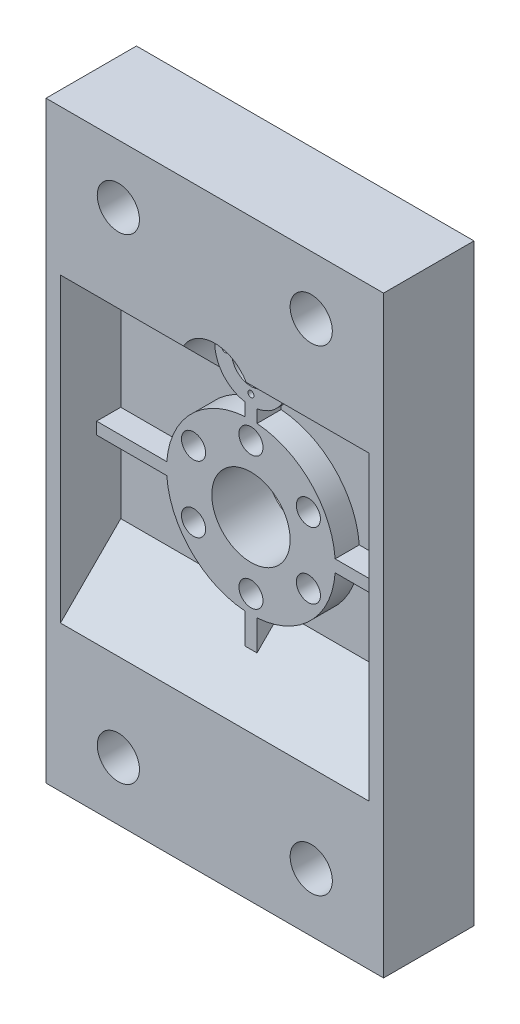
from build123d import *

# Parameters (mm, degrees)
SKETCH_1_W           = 280
SKETCH_1_H           = 492
SKETCH_1_R           = 32.5
SKETCH_1_R_2         = 17.5
SKETCH_1_R_3         = 16
EXTRUDE_1_DEPTH      = 75
SKETCH_2_W           = 122
SKETCH_2_H           = 85
SKETCH_2_R           = 17.5
CUT_EXTRUDE_1_DEPTH  = 50
CUT_EXTRUDE_3_DEPTH  = 122
CUT_EXTRUDE_4_DEPTH  = 122
EXTRUDE_2_REACH      = 294.816
SKETCH_7_W           = 256
SKETCH_7_H           = 150
CUT_EXTRUDE_5_DEPTH  = 50
CUT_EXTRUDE_6_REACH  = 373.436
CUT_EXTRUDE_START    = -30
SKETCH_9_R           = 30
SKETCH_9_R_2         = 16
CUT_EXTRUDE_7_DEPTH  = 30
EXTRUDE_5_REACH      = 288.603
SKETCH_11_R          = 70
SKETCH_11_R_2        = 32.5
EXTRUDE_6_DEPTH      = 20
EXTRUDE_START        = -20
EXTRUDE_7_DEPTH      = 20
EXTRUDE_8_REACH      = 360.142
SKETCH_13_W          = 10
SKETCH_13_H          = 20
SKETCH_14_R          = 2.5
CUT_EXTRUDE_8_DEPTH  = 13
SKETCH_15_R          = 6.5
CUT_EXTRUDE_9_DEPTH  = 287.602512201
SKETCH_16_R          = 10
CUT_EXTRUDE_10_DEPTH = 15


with BuildPart() as part:
    # Sketch 1 → Extrude 1 (new body)
    with BuildSketch(Plane.XY):
        Rectangle(SKETCH_1_W, SKETCH_1_H)
        Circle(SKETCH_1_R, mode=Mode.SUBTRACT)
        with Locations((80, 197.5)):
            Circle(SKETCH_1_R_2, mode=Mode.SUBTRACT)
        with Locations(Location((80, -197.5, 0), (0, 0, 180))):
            Circle(SKETCH_1_R_2, mode=Mode.SUBTRACT)
        with Locations((-80, -197.5)):
            Circle(SKETCH_1_R_2, mode=Mode.SUBTRACT)
        with Locations(Location((-80, 197.5, 0), (0, 0, 180))):
            Circle(SKETCH_1_R_2, mode=Mode.SUBTRACT)
        with Locations((0, 110)):
            Circle(SKETCH_1_R_3, mode=Mode.SUBTRACT)
    extrude(amount=EXTRUDE_1_DEPTH)

    # Sketch 2 → Cut-Extrude 1 (cut)
    # profile 1 of 4: a face of its own
    with BuildSketch(Plane(origin=(0, 0, 0), x_dir=(-1, 0, 0), z_dir=(0, 0, -1))):
        with Locations((67, -191.5)):
            Rectangle(SKETCH_2_W, SKETCH_2_H)
        with Locations((80, -197.5)):
            Circle(SKETCH_2_R, mode=Mode.SUBTRACT)
    # profile 2 of 4: a face of its own
    with BuildSketch(Plane(origin=(0, 0, 0), x_dir=(-1, 0, 0), z_dir=(0, 0, -1))):
        with Locations((-67, -191.5)):
            Rectangle(SKETCH_2_W, SKETCH_2_H)
        with Locations((-80, -197.5)):
            Circle(SKETCH_2_R, mode=Mode.SUBTRACT)
    # profile 3 of 4: a face of its own
    with BuildSketch(Plane(origin=(0, 0, 0), x_dir=(-1, 0, 0), z_dir=(0, 0, -1))):
        with Locations((67, 191.5)):
            Rectangle(SKETCH_2_W, SKETCH_2_H)
        with Locations((80, 197.5)):
            Circle(SKETCH_2_R, mode=Mode.SUBTRACT)
    # profile 4 of 4: a face of its own
    with BuildSketch(Plane(origin=(0, 0, 0), x_dir=(-1, 0, 0), z_dir=(0, 0, -1))):
        with Locations((-67, 191.5)):
            Rectangle(SKETCH_2_W, SKETCH_2_H)
        with Locations((-80, 197.5)):
            Circle(SKETCH_2_R, mode=Mode.SUBTRACT)
    extrude(amount=-CUT_EXTRUDE_1_DEPTH, mode=Mode.SUBTRACT)

    # Sketch 4 → Cut-Extrude 3 (cut)
    with BuildSketch(Plane(origin=(6, 0, 0), x_dir=(0, 0, -1), z_dir=(1, 0, 0))):
        Polygon((-50, 149), (0, 149), (0, 99), align=None)
        Polygon((0, -100.305438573), (-48.694561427, -149), (0, -149), align=None)
    extrude(amount=CUT_EXTRUDE_3_DEPTH, mode=Mode.SUBTRACT)

    # Sketch 5 → Cut-Extrude 4 (cut)
    with BuildSketch(Plane(origin=(-128, 0, 0), x_dir=(0, 0, -1), z_dir=(1, 0, 0))):
        Polygon((-50, 149), (0, 99), (0, 149), align=None)
        Polygon((0, -100.305438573), (-48.694561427, -149), (0, -149), align=None)
    extrude(amount=CUT_EXTRUDE_4_DEPTH, mode=Mode.SUBTRACT)

    # Extrude 2: up to this face of the body (flat: up to its plane)
    extrude_2_end = Plane(part.part.faces().sort_by_distance((68.946166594, 124.45412291, 25.45412291))[0])
    # Sketch 6 → Extrude 2 (add, up to the picked face)
    with BuildSketch(Plane(origin=(0, 0, 0), x_dir=(-1, 0, 0), z_dir=(0, 0, -1)), mode=Mode.PRIVATE) as extrude_2_sk1:
        with BuildLine():
            Line((6, 139.393876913), (6, 124.832396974))
            ThreePointArc((6, 124.832396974), (13.266499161, 118.94427191), (16, 110))
            ThreePointArc((16, 110), (14.8644408, 104.07983111), (11.618950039, 99))
            Line((11.618950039, 99), (27.910571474, 99))
            ThreePointArc((27.910571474, 99), (26.370400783, 124.303914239), (6, 139.393876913))
        make_face()
    extrude_2_tool1 = split(extrude(extrude_2_sk1.sketch, amount=-EXTRUDE_2_REACH, mode=Mode.PRIVATE), bisect_by=extrude_2_end, keep=Keep.BOTH, mode=Mode.PRIVATE)
    # Sketch 6 → Extrude 2 (add, up to the picked face)
    with BuildSketch(Plane(origin=(0, 0, 0), x_dir=(-1, 0, 0), z_dir=(0, 0, -1)), mode=Mode.PRIVATE) as extrude_2_sk2:
        with BuildLine():
            ThreePointArc((-11.618950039, 99), (-15.634418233, 113.400730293), (-6, 124.832396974))
            Line((-6, 124.832396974), (-6, 139.393876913))
            ThreePointArc((-6, 139.393876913), (-26.370400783, 124.303914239), (-27.910571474, 99))
            Line((-27.910571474, 99), (-11.618950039, 99))
        make_face()
    extrude_2_tool2 = split(extrude(extrude_2_sk2.sketch, amount=-EXTRUDE_2_REACH, mode=Mode.PRIVATE), bisect_by=extrude_2_end, keep=Keep.BOTH, mode=Mode.PRIVATE)
    add(extrude_2_tool1.solids().sort_by(Axis((-18.75536, 118.231597, 0), (0, 0, 1)))[0])
    add(extrude_2_tool2.solids().sort_by(Axis((18.75536, 118.231597, 0), (0, 0, 1)))[0])

    # Sketch 7 → Cut-Extrude 5 (cut)
    with BuildSketch(Plane.XY.offset(75)):
        Rectangle(SKETCH_7_W, SKETCH_7_H)
    extrude(amount=-CUT_EXTRUDE_5_DEPTH, mode=Mode.SUBTRACT)

    # Cut-Extrude 6: up to this face of the body (flat: up to its plane)
    cut_extrude_6_end = Plane(part.part.faces().sort_by_distance((-128, 0, 50))[0])
    # Sketch 8 → Cut-Extrude 6 (cut, up to the picked face)
    with BuildSketch(Plane.ZY.offset(-128), mode=Mode.PRIVATE) as cut_extrude_6_sk1:
        Polygon((25, -75), (75, -75), (75, -125), align=None)
    cut_extrude_6_tool1 = split(extrude(cut_extrude_6_sk1.sketch, amount=CUT_EXTRUDE_6_REACH, mode=Mode.PRIVATE), bisect_by=cut_extrude_6_end, keep=Keep.BOTH, mode=Mode.PRIVATE)
    # Sketch 8 → Cut-Extrude 6 (cut, up to the picked face)
    with BuildSketch(Plane.ZY.offset(-128), mode=Mode.PRIVATE) as cut_extrude_6_sk2:
        Polygon((25, 75), (75, 75), (75, 125), align=None)
    cut_extrude_6_tool2 = split(extrude(cut_extrude_6_sk2.sketch, amount=CUT_EXTRUDE_6_REACH, mode=Mode.PRIVATE), bisect_by=cut_extrude_6_end, keep=Keep.BOTH, mode=Mode.PRIVATE)
    add(cut_extrude_6_tool1.solids().sort_by(Axis((128, -91.666667, 58.333333), (-1, 0, 0)))[0], mode=Mode.SUBTRACT)
    add(cut_extrude_6_tool2.solids().sort_by(Axis((128, 91.666667, 58.333333), (-1, 0, 0)))[0], mode=Mode.SUBTRACT)

    # Sketch 9 → Cut-Extrude 7 (cut)
    with BuildSketch(Plane.XY.offset(75).offset(CUT_EXTRUDE_START)):
        with Locations((0, 110)):
            Circle(SKETCH_9_R)
        with Locations(Location((0, 110, 0), (0, 0, 249.635865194))):
            Circle(SKETCH_9_R_2, mode=Mode.SUBTRACT)
    extrude(amount=CUT_EXTRUDE_7_DEPTH, mode=Mode.SUBTRACT)

    # Sketch 10 → Extrude 5 (add, up to next)
    with BuildSketch(Plane.XY.offset(45), mode=Mode.PRIVATE) as extrude_5_sk1:
        with BuildLine():
            Line((-5.567764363, 95), (-25.980762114, 95))
            ThreePointArc((-25.980762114, 95), (0, 80), (25.980762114, 95))
            Line((25.980762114, 95), (5.567764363, 95))
            ThreePointArc((5.567764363, 95), (0, 94), (-5.567764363, 95))
        make_face()
    extrude_5_tool1 = extrude(extrude_5_sk1.sketch, amount=-EXTRUDE_5_REACH, mode=Mode.PRIVATE) - part.part
    add(extrude_5_tool1.solids().sort_by_distance((0, 88.770618, 45))[0])

    # Sketch 11 → Extrude 6 (add)
    with BuildSketch(Plane.XY.offset(25)):
        with Locations(Location((0, 0, 0), (0, 0, 180))):
            Circle(SKETCH_11_R)
        Circle(SKETCH_11_R_2, mode=Mode.SUBTRACT)
    extrude(amount=EXTRUDE_6_DEPTH)

    # Sketch 12 → Extrude 7 (add)
    with BuildSketch(Plane.XY.offset(45).offset(EXTRUDE_START)):
        with BuildLine():
            Line((-5, 80.419601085), (-5, 69.821200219))
            ThreePointArc((-5, 69.821200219), (0, 70), (5, 69.821200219))
            Line((5, 69.821200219), (5, 80.419601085))
            ThreePointArc((5, 80.419601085), (0, 80), (-5, 80.419601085))
        make_face()
        with BuildLine():
            ThreePointArc((70, 0), (69.955285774, -2.501597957), (69.821200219, -5))
            Line((69.821200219, -5), (128, -5))
            Line((128, -5), (128, 5))
            Line((128, 5), (69.821200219, 5))
            ThreePointArc((69.821200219, 5), (69.955285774, 2.501597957), (70, 0))
        make_face()
        with BuildLine():
            Line((-5, -69.821200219), (-5, -75))
            Line((-5, -75), (5, -75))
            Line((5, -75), (5, -69.821200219))
            ThreePointArc((5, -69.821200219), (0, -70), (-5, -69.821200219))
        make_face()
        with BuildLine():
            Line((-128, -5), (-69.821200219, -5))
            ThreePointArc((-69.821200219, -5), (-70, 0), (-69.821200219, 5))
            Line((-69.821200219, 5), (-128, 5))
            Line((-128, 5), (-128, -5))
        make_face()
    extrude(amount=EXTRUDE_7_DEPTH)

    # Sketch 13 → Extrude 8 (add, up to next)
    with BuildSketch(Plane.XZ.offset(75), mode=Mode.PRIVATE) as extrude_8_sk1:
        with Locations((0, 35)):
            Rectangle(SKETCH_13_W, SKETCH_13_H)
    extrude_8_tool1 = extrude(extrude_8_sk1.sketch, amount=EXTRUDE_8_REACH, mode=Mode.PRIVATE) - part.part
    add(extrude_8_tool1.solids().sort_by_distance((0, -75, 35))[0])

    # Sketch 14 → Cut-Extrude 8 (cut)
    with BuildSketch(Plane.XY.offset(45)):
        with Locations((0, 88.5)):
            Circle(SKETCH_14_R)
        with Locations((-21.5, 110)):
            Circle(SKETCH_14_R)
        with Locations((0, 131.5)):
            Circle(SKETCH_14_R)
        with Locations((21.5, 110)):
            Circle(SKETCH_14_R)
    extrude(amount=-CUT_EXTRUDE_8_DEPTH, mode=Mode.SUBTRACT)

    # Sketch 15 → Cut-Extrude 9 (cut, through all)
    with BuildSketch(Plane.XY.offset(45)):
        with Locations((0, 55)):
            Circle(SKETCH_15_R)
        with Locations((47.631397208, 27.5)):
            Circle(SKETCH_15_R)
        with Locations((47.631397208, -27.5)):
            Circle(SKETCH_15_R)
        with Locations((0, -55)):
            Circle(SKETCH_15_R)
        with Locations((-47.631397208, -27.5)):
            Circle(SKETCH_15_R)
        with Locations((-47.631397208, 27.5)):
            Circle(SKETCH_15_R)
    extrude(amount=-CUT_EXTRUDE_9_DEPTH, mode=Mode.SUBTRACT)

    # Sketch 16 → Cut-Extrude 10 (cut)
    with BuildSketch(Plane.XY.offset(45)):
        with Locations((0, 55)):
            Circle(SKETCH_16_R)
        with Locations((0, -55)):
            Circle(SKETCH_16_R)
        with Locations((47.631397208, 27.5)):
            Circle(SKETCH_16_R)
        with Locations((47.631397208, -27.5)):
            Circle(SKETCH_16_R)
        with Locations((-47.631397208, 27.5)):
            Circle(SKETCH_16_R)
        with Locations((-47.631397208, -27.5)):
            Circle(SKETCH_16_R)
    extrude(amount=-CUT_EXTRUDE_10_DEPTH, mode=Mode.SUBTRACT)


solid = part.part
